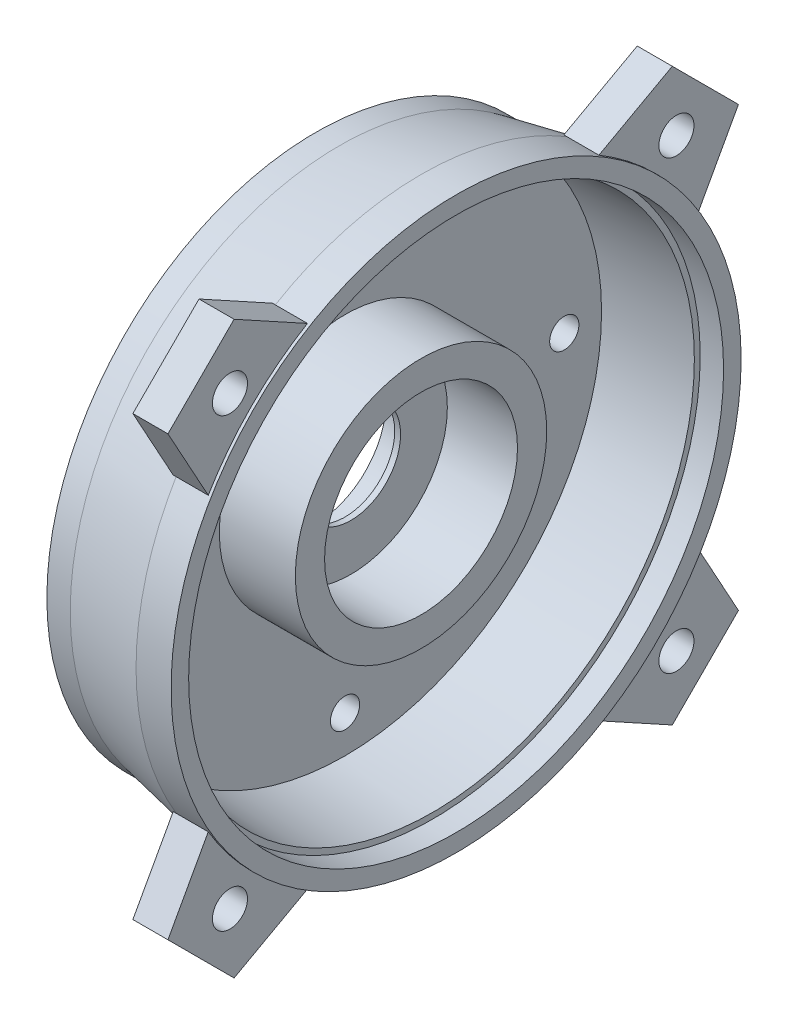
ISO-10303-21;
HEADER;
FILE_DESCRIPTION(('STEP AP214'),'2;1');
FILE_NAME('part.step','',(''),(''),'','','');
FILE_SCHEMA(('AUTOMOTIVE_DESIGN { 1 0 10303 214 1 1 1 1 }'));
ENDSEC;
DATA;
#1=APPLICATION_CONTEXT('core data for automotive mechanical design processes');
#2=APPLICATION_PROTOCOL_DEFINITION('international standard','automotive_design',2000,#1);
#3=PRODUCT_CONTEXT('',#1,'mechanical');
#4=PRODUCT('Part','Part','',(#3));
#5=PRODUCT_RELATED_PRODUCT_CATEGORY('part','',(#4));
#6=PRODUCT_DEFINITION_FORMATION('','',#4);
#7=PRODUCT_DEFINITION_CONTEXT('part definition',#1,'design');
#8=PRODUCT_DEFINITION('design','',#6,#7);
#9=PRODUCT_DEFINITION_SHAPE('','',#8);
#10=(LENGTH_UNIT() NAMED_UNIT(*) SI_UNIT(.MILLI.,.METRE.));
#11=(NAMED_UNIT(*) PLANE_ANGLE_UNIT() SI_UNIT($,.RADIAN.));
#12=(NAMED_UNIT(*) SI_UNIT($,.STERADIAN.) SOLID_ANGLE_UNIT());
#13=UNCERTAINTY_MEASURE_WITH_UNIT(LENGTH_MEASURE(1.E-05),#10,'distance_accuracy_value','');
#14=(GEOMETRIC_REPRESENTATION_CONTEXT(3) GLOBAL_UNCERTAINTY_ASSIGNED_CONTEXT((#13)) GLOBAL_UNIT_ASSIGNED_CONTEXT((#10,
#11,#12)) REPRESENTATION_CONTEXT('',''));
#15=CARTESIAN_POINT('',(0.,0.,0.));
#16=DIRECTION('',(0.,0.,1.));
#17=DIRECTION('',(1.,0.,0.));
#18=AXIS2_PLACEMENT_3D('',#15,#16,#17);
#19=CARTESIAN_POINT('',(110.,0.,0.));
#20=DIRECTION('',(1.,0.,0.));
#21=DIRECTION('',(0.,0.,-1.));
#22=AXIS2_PLACEMENT_3D('',#19,#20,#21);
#23=CYLINDRICAL_SURFACE('',#22,8.5);
#24=CARTESIAN_POINT('',(0.,0.,0.));
#25=DIRECTION('',(1.,0.,0.));
#26=DIRECTION('',(0.,0.,-1.));
#27=AXIS2_PLACEMENT_3D('',#24,#25,#26);
#28=CIRCLE('',#27,8.5);
#29=CARTESIAN_POINT('',(0.,0.,-8.5));
#30=VERTEX_POINT('',#29);
#31=EDGE_CURVE('E501',#30,#30,#28,.T.);
#32=ORIENTED_EDGE('',*,*,#31,.F.);
#33=EDGE_LOOP('',(#32));
#34=FACE_BOUND('',#33,.T.);
#35=CARTESIAN_POINT('',(1.,0.,0.));
#36=DIRECTION('',(1.,0.,0.));
#37=DIRECTION('',(0.,0.,-1.));
#38=AXIS2_PLACEMENT_3D('',#35,#36,#37);
#39=CIRCLE('',#38,8.5);
#40=CARTESIAN_POINT('',(1.,0.,-8.5));
#41=VERTEX_POINT('',#40);
#42=EDGE_CURVE('E410',#41,#41,#39,.T.);
#43=ORIENTED_EDGE('',*,*,#42,.T.);
#44=EDGE_LOOP('',(#43));
#45=FACE_BOUND('',#44,.T.);
#46=ADVANCED_FACE('F16',(#34,#45),#23,.F.);
#47=CARTESIAN_POINT('',(0.,-8.5,0.));
#48=DIRECTION('',(1.,0.,0.));
#49=DIRECTION('',(0.,0.,-1.));
#50=AXIS2_PLACEMENT_3D('',#47,#48,#49);
#51=PLANE('',#50);
#52=CARTESIAN_POINT('',(0.,0.,0.));
#53=DIRECTION('',(1.,0.,0.));
#54=DIRECTION('',(0.,0.,-1.));
#55=AXIS2_PLACEMENT_3D('',#52,#53,#54);
#56=CIRCLE('',#55,12.);
#57=CARTESIAN_POINT('',(0.,0.,-12.));
#58=VERTEX_POINT('',#57);
#59=EDGE_CURVE('E497',#58,#58,#56,.T.);
#60=ORIENTED_EDGE('',*,*,#59,.F.);
#61=EDGE_LOOP('',(#60));
#62=FACE_BOUND('',#61,.T.);
#63=ORIENTED_EDGE('',*,*,#31,.T.);
#64=EDGE_LOOP('',(#63));
#65=FACE_BOUND('',#64,.T.);
#66=ADVANCED_FACE('F573',(#62,#65),#51,.F.);
#67=CARTESIAN_POINT('',(110.,0.,0.));
#68=DIRECTION('',(1.,0.,0.));
#69=DIRECTION('',(0.,0.,-1.));
#70=AXIS2_PLACEMENT_3D('',#67,#68,#69);
#71=CYLINDRICAL_SURFACE('',#70,12.);
#72=CARTESIAN_POINT('',(-5.,0.,0.));
#73=DIRECTION('',(1.,0.,0.));
#74=DIRECTION('',(0.,0.,-1.));
#75=AXIS2_PLACEMENT_3D('',#72,#73,#74);
#76=CIRCLE('',#75,12.);
#77=CARTESIAN_POINT('',(-5.,0.,-12.));
#78=VERTEX_POINT('',#77);
#79=EDGE_CURVE('E493',#78,#78,#76,.T.);
#80=ORIENTED_EDGE('',*,*,#79,.F.);
#81=EDGE_LOOP('',(#80));
#82=FACE_BOUND('',#81,.T.);
#83=ORIENTED_EDGE('',*,*,#59,.T.);
#84=EDGE_LOOP('',(#83));
#85=FACE_BOUND('',#84,.T.);
#86=ADVANCED_FACE('F578',(#82,#85),#71,.F.);
#87=CARTESIAN_POINT('',(-5.,-12.,0.));
#88=DIRECTION('',(1.,0.,0.));
#89=DIRECTION('',(0.,0.,-1.));
#90=AXIS2_PLACEMENT_3D('',#87,#88,#89);
#91=PLANE('',#90);
#92=CARTESIAN_POINT('',(-5.,0.,0.));
#93=DIRECTION('',(1.,0.,0.));
#94=DIRECTION('',(0.,0.,-1.));
#95=AXIS2_PLACEMENT_3D('',#92,#93,#94);
#96=CIRCLE('',#95,16.);
#97=CARTESIAN_POINT('',(-5.,0.,-16.));
#98=VERTEX_POINT('',#97);
#99=EDGE_CURVE('E489',#98,#98,#96,.T.);
#100=ORIENTED_EDGE('',*,*,#99,.F.);
#101=EDGE_LOOP('',(#100));
#102=FACE_BOUND('',#101,.T.);
#103=ORIENTED_EDGE('',*,*,#79,.T.);
#104=EDGE_LOOP('',(#103));
#105=FACE_BOUND('',#104,.T.);
#106=ADVANCED_FACE('F674',(#102,#105),#91,.F.);
#107=CARTESIAN_POINT('',(110.,0.,0.));
#108=DIRECTION('',(1.,0.,0.));
#109=DIRECTION('',(0.,0.,-1.));
#110=AXIS2_PLACEMENT_3D('',#107,#108,#109);
#111=CYLINDRICAL_SURFACE('',#110,16.);
#112=CARTESIAN_POINT('',(-2.5,0.,0.));
#113=DIRECTION('',(1.,0.,0.));
#114=DIRECTION('',(0.,0.,-1.));
#115=AXIS2_PLACEMENT_3D('',#112,#113,#114);
#116=CIRCLE('',#115,16.);
#117=CARTESIAN_POINT('',(-2.5,0.,-16.));
#118=VERTEX_POINT('',#117);
#119=EDGE_CURVE('E485',#118,#118,#116,.T.);
#120=ORIENTED_EDGE('',*,*,#119,.F.);
#121=EDGE_LOOP('',(#120));
#122=FACE_BOUND('',#121,.T.);
#123=ORIENTED_EDGE('',*,*,#99,.T.);
#124=EDGE_LOOP('',(#123));
#125=FACE_BOUND('',#124,.T.);
#126=ADVANCED_FACE('F670',(#122,#125),#111,.T.);
#127=CARTESIAN_POINT('',(-2.5,-16.,0.));
#128=DIRECTION('',(1.,0.,0.));
#129=DIRECTION('',(0.,0.,-1.));
#130=AXIS2_PLACEMENT_3D('',#127,#128,#129);
#131=PLANE('',#130);
#132=CARTESIAN_POINT('',(-2.5,0.,0.));
#133=DIRECTION('',(1.,0.,0.));
#134=DIRECTION('',(0.,0.,-1.));
#135=AXIS2_PLACEMENT_3D('',#132,#133,#134);
#136=CIRCLE('',#135,22.75);
#137=CARTESIAN_POINT('',(-2.5,0.,-22.75));
#138=VERTEX_POINT('',#137);
#139=EDGE_CURVE('E481',#138,#138,#136,.T.);
#140=ORIENTED_EDGE('',*,*,#139,.F.);
#141=EDGE_LOOP('',(#140));
#142=FACE_BOUND('',#141,.T.);
#143=ORIENTED_EDGE('',*,*,#119,.T.);
#144=EDGE_LOOP('',(#143));
#145=FACE_BOUND('',#144,.T.);
#146=ADVANCED_FACE('F666',(#142,#145),#131,.F.);
#147=CARTESIAN_POINT('',(110.,0.,0.));
#148=DIRECTION('',(1.,0.,0.));
#149=DIRECTION('',(0.,0.,-1.));
#150=AXIS2_PLACEMENT_3D('',#147,#148,#149);
#151=CYLINDRICAL_SURFACE('',#150,22.75);
#152=CARTESIAN_POINT('',(-7.5,0.,0.));
#153=DIRECTION('',(1.,0.,0.));
#154=DIRECTION('',(0.,0.,-1.));
#155=AXIS2_PLACEMENT_3D('',#152,#153,#154);
#156=CIRCLE('',#155,22.75);
#157=CARTESIAN_POINT('',(-7.5,0.,-22.75));
#158=VERTEX_POINT('',#157);
#159=EDGE_CURVE('E477',#158,#158,#156,.T.);
#160=ORIENTED_EDGE('',*,*,#159,.F.);
#161=EDGE_LOOP('',(#160));
#162=FACE_BOUND('',#161,.T.);
#163=ORIENTED_EDGE('',*,*,#139,.T.);
#164=EDGE_LOOP('',(#163));
#165=FACE_BOUND('',#164,.T.);
#166=ADVANCED_FACE('F662',(#162,#165),#151,.F.);
#167=CARTESIAN_POINT('',(-7.5,-22.75,0.));
#168=DIRECTION('',(1.,0.,0.));
#169=DIRECTION('',(0.,0.,-1.));
#170=AXIS2_PLACEMENT_3D('',#167,#168,#169);
#171=PLANE('',#170);
#172=CARTESIAN_POINT('',(-7.5,0.,0.));
#173=DIRECTION('',(1.,0.,0.));
#174=DIRECTION('',(0.,0.,-1.));
#175=AXIS2_PLACEMENT_3D('',#172,#173,#174);
#176=CIRCLE('',#175,30.);
#177=CARTESIAN_POINT('',(-7.5,0.,-30.));
#178=VERTEX_POINT('',#177);
#179=EDGE_CURVE('E473',#178,#178,#176,.T.);
#180=ORIENTED_EDGE('',*,*,#179,.F.);
#181=EDGE_LOOP('',(#180));
#182=FACE_BOUND('',#181,.T.);
#183=ORIENTED_EDGE('',*,*,#159,.T.);
#184=EDGE_LOOP('',(#183));
#185=FACE_BOUND('',#184,.T.);
#186=ADVANCED_FACE('F658',(#182,#185),#171,.F.);
#187=CARTESIAN_POINT('',(110.,0.,0.));
#188=DIRECTION('',(1.,0.,0.));
#189=DIRECTION('',(0.,0.,-1.));
#190=AXIS2_PLACEMENT_3D('',#187,#188,#189);
#191=CYLINDRICAL_SURFACE('',#190,30.);
#192=CARTESIAN_POINT('',(-5.,0.,0.));
#193=DIRECTION('',(1.,0.,0.));
#194=DIRECTION('',(0.,0.,-1.));
#195=AXIS2_PLACEMENT_3D('',#192,#193,#194);
#196=CIRCLE('',#195,30.);
#197=CARTESIAN_POINT('',(-5.,0.,-30.));
#198=VERTEX_POINT('',#197);
#199=EDGE_CURVE('E469',#198,#198,#196,.T.);
#200=ORIENTED_EDGE('',*,*,#199,.F.);
#201=EDGE_LOOP('',(#200));
#202=FACE_BOUND('',#201,.T.);
#203=ORIENTED_EDGE('',*,*,#179,.T.);
#204=EDGE_LOOP('',(#203));
#205=FACE_BOUND('',#204,.T.);
#206=ADVANCED_FACE('F654',(#202,#205),#191,.T.);
#207=CARTESIAN_POINT('',(-5.,-30.,0.));
#208=DIRECTION('',(1.,0.,0.));
#209=DIRECTION('',(0.,0.,-1.));
#210=AXIS2_PLACEMENT_3D('',#207,#208,#209);
#211=PLANE('',#210);
#212=CARTESIAN_POINT('',(-4.99999999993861,-1.45716771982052E-13,-37.5));
#213=DIRECTION('',(-1.,0.,0.));
#214=DIRECTION('',(0.,0.,-1.));
#215=AXIS2_PLACEMENT_3D('',#212,#213,#214);
#216=CIRCLE('',#215,2.5);
#217=CARTESIAN_POINT('',(-4.99999999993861,-1.45716771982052E-13,-40.));
#218=VERTEX_POINT('',#217);
#219=EDGE_CURVE('E222',#218,#218,#216,.T.);
#220=ORIENTED_EDGE('',*,*,#219,.F.);
#221=EDGE_LOOP('',(#220));
#222=FACE_BOUND('',#221,.T.);
#223=CARTESIAN_POINT('',(-4.99999999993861,-37.5,2.81025203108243E-13));
#224=DIRECTION('',(-1.,0.,0.));
#225=DIRECTION('',(0.,0.,1.));
#226=AXIS2_PLACEMENT_3D('',#223,#224,#225);
#227=CIRCLE('',#226,2.5);
#228=CARTESIAN_POINT('',(-4.99999999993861,-37.5,2.50000000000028));
#229=VERTEX_POINT('',#228);
#230=EDGE_CURVE('E205',#229,#229,#227,.T.);
#231=ORIENTED_EDGE('',*,*,#230,.F.);
#232=EDGE_LOOP('',(#231));
#233=FACE_BOUND('',#232,.T.);
#234=CARTESIAN_POINT('',(-4.99999999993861,-1.31838984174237E-13,37.5));
#235=DIRECTION('',(-1.,0.,0.));
#236=DIRECTION('',(0.,0.,-1.));
#237=AXIS2_PLACEMENT_3D('',#234,#235,#236);
#238=CIRCLE('',#237,2.5);
#239=CARTESIAN_POINT('',(-4.99999999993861,-1.31838984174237E-13,35.));
#240=VERTEX_POINT('',#239);
#241=EDGE_CURVE('E201',#240,#240,#238,.T.);
#242=ORIENTED_EDGE('',*,*,#241,.F.);
#243=EDGE_LOOP('',(#242));
#244=FACE_BOUND('',#243,.T.);
#245=CARTESIAN_POINT('',(-4.99999999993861,37.5,0.));
#246=DIRECTION('',(-1.,0.,0.));
#247=DIRECTION('',(0.,0.,1.));
#248=AXIS2_PLACEMENT_3D('',#245,#246,#247);
#249=CIRCLE('',#248,2.5);
#250=CARTESIAN_POINT('',(-4.99999999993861,37.5,2.5));
#251=VERTEX_POINT('',#250);
#252=EDGE_CURVE('E197',#251,#251,#249,.T.);
#253=ORIENTED_EDGE('',*,*,#252,.F.);
#254=EDGE_LOOP('',(#253));
#255=FACE_BOUND('',#254,.T.);
#256=CARTESIAN_POINT('',(-5.,0.,0.));
#257=DIRECTION('',(1.,0.,0.));
#258=DIRECTION('',(0.,0.,-1.));
#259=AXIS2_PLACEMENT_3D('',#256,#257,#258);
#260=CIRCLE('',#259,46.);
#261=CARTESIAN_POINT('',(-5.,0.,-46.));
#262=VERTEX_POINT('',#261);
#263=EDGE_CURVE('E466',#262,#262,#260,.T.);
#264=ORIENTED_EDGE('',*,*,#263,.F.);
#265=EDGE_LOOP('',(#264));
#266=FACE_BOUND('',#265,.T.);
#267=ORIENTED_EDGE('',*,*,#199,.T.);
#268=EDGE_LOOP('',(#267));
#269=FACE_BOUND('',#268,.T.);
#270=ADVANCED_FACE('F650',(#222,#233,#244,#255,#266,#269),#211,.F.);
#271=CARTESIAN_POINT('',(110.,0.,0.));
#272=DIRECTION('',(1.,0.,0.));
#273=DIRECTION('',(0.,0.,-1.));
#274=AXIS2_PLACEMENT_3D('',#271,#272,#273);
#275=CYLINDRICAL_SURFACE('',#274,46.);
#276=CARTESIAN_POINT('',(-1.00000000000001,0.,0.));
#277=DIRECTION('',(1.,0.,0.));
#278=DIRECTION('',(0.,0.,-1.));
#279=AXIS2_PLACEMENT_3D('',#276,#277,#278);
#280=CIRCLE('',#279,46.);
#281=CARTESIAN_POINT('',(-1.00000000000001,0.,-46.));
#282=VERTEX_POINT('',#281);
#283=EDGE_CURVE('E461',#282,#282,#280,.T.);
#284=ORIENTED_EDGE('',*,*,#283,.F.);
#285=EDGE_LOOP('',(#284));
#286=FACE_BOUND('',#285,.T.);
#287=ORIENTED_EDGE('',*,*,#263,.T.);
#288=EDGE_LOOP('',(#287));
#289=FACE_BOUND('',#288,.T.);
#290=ADVANCED_FACE('F645',(#286,#289),#275,.T.);
#291=CARTESIAN_POINT('',(-1.00000000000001,0.,0.));
#292=DIRECTION('',(1.,0.,0.));
#293=DIRECTION('',(0.,0.,-1.));
#294=AXIS2_PLACEMENT_3D('',#291,#292,#293);
#295=CONICAL_SURFACE('',#294,46.,0.193959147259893);
#296=CARTESIAN_POINT('',(13.,0.,0.));
#297=DIRECTION('',(1.,0.,0.));
#298=DIRECTION('',(0.,0.,-1.));
#299=AXIS2_PLACEMENT_3D('',#296,#297,#298);
#300=CIRCLE('',#299,48.75);
#301=CARTESIAN_POINT('',(13.,41.896076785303,24.9255140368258));
#302=VERTEX_POINT('',#301);
#303=CARTESIAN_POINT('',(13.,24.9255140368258,41.896076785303));
#304=VERTEX_POINT('',#303);
#305=EDGE_CURVE('E459',#302,#304,#300,.T.);
#306=ORIENTED_EDGE('',*,*,#305,.F.);
#307=CARTESIAN_POINT('',(13.,41.8960767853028,-24.9255140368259));
#308=VERTEX_POINT('',#307);
#309=EDGE_CURVE('E458',#308,#302,#300,.T.);
#310=ORIENTED_EDGE('',*,*,#309,.F.);
#311=CARTESIAN_POINT('',(13.,24.9255140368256,-41.8960767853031));
#312=VERTEX_POINT('',#311);
#313=EDGE_CURVE('E544',#312,#308,#300,.T.);
#314=ORIENTED_EDGE('',*,*,#313,.F.);
#315=CARTESIAN_POINT('',(13.,-24.9255140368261,-41.8960767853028));
#316=VERTEX_POINT('',#315);
#317=EDGE_CURVE('E538',#316,#312,#300,.T.);
#318=ORIENTED_EDGE('',*,*,#317,.F.);
#319=CARTESIAN_POINT('',(13.,-41.8960767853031,-24.9255140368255));
#320=VERTEX_POINT('',#319);
#321=EDGE_CURVE('E529',#320,#316,#300,.T.);
#322=ORIENTED_EDGE('',*,*,#321,.F.);
#323=CARTESIAN_POINT('',(13.,-41.8960767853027,24.9255140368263));
#324=VERTEX_POINT('',#323);
#325=EDGE_CURVE('E462',#324,#320,#300,.T.);
#326=ORIENTED_EDGE('',*,*,#325,.F.);
#327=CARTESIAN_POINT('',(13.,-24.9255140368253,41.8960767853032));
#328=VERTEX_POINT('',#327);
#329=EDGE_CURVE('E542',#328,#324,#300,.T.);
#330=ORIENTED_EDGE('',*,*,#329,.F.);
#331=EDGE_CURVE('E179',#304,#328,#300,.T.);
#332=ORIENTED_EDGE('',*,*,#331,.F.);
#333=EDGE_LOOP('',(#306,#310,#314,#318,#322,#326,#330,#332));
#334=FACE_BOUND('',#333,.T.);
#335=ORIENTED_EDGE('',*,*,#283,.T.);
#336=EDGE_LOOP('',(#335));
#337=FACE_BOUND('',#336,.T.);
#338=ADVANCED_FACE('F534',(#334,#337),#295,.T.);
#339=CARTESIAN_POINT('',(110.,0.,0.));
#340=DIRECTION('',(1.,0.,0.));
#341=DIRECTION('',(0.,0.,-1.));
#342=AXIS2_PLACEMENT_3D('',#339,#340,#341);
#343=CYLINDRICAL_SURFACE('',#342,48.75);
#344=CARTESIAN_POINT('',(19.,0.,0.));
#345=DIRECTION('',(1.,0.,0.));
#346=DIRECTION('',(0.,0.,-1.));
#347=AXIS2_PLACEMENT_3D('',#344,#345,#346);
#348=CIRCLE('',#347,48.75);
#349=CARTESIAN_POINT('',(19.,0.,-48.75));
#350=VERTEX_POINT('',#349);
#351=EDGE_CURVE('E454',#350,#350,#348,.T.);
#352=ORIENTED_EDGE('',*,*,#351,.F.);
#353=EDGE_LOOP('',(#352));
#354=FACE_BOUND('',#353,.T.);
#355=CARTESIAN_POINT('',(18.5,0.,0.));
#356=DIRECTION('',(-1.,0.,0.));
#357=DIRECTION('',(0.,1.,0.));
#358=AXIS2_PLACEMENT_3D('',#355,#356,#357);
#359=CIRCLE('',#358,48.75);
#360=CARTESIAN_POINT('',(18.5,-41.8960767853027,24.9255140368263));
#361=VERTEX_POINT('',#360);
#362=CARTESIAN_POINT('',(18.5,-24.9255140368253,41.8960767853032));
#363=VERTEX_POINT('',#362);
#364=EDGE_CURVE('E167',#361,#363,#359,.T.);
#365=ORIENTED_EDGE('',*,*,#364,.F.);
#366=DIRECTION('',(1.,0.,0.));
#367=VECTOR('',#366,1.);
#368=CARTESIAN_POINT('',(110.,-41.8960767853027,24.9255140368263));
#369=LINE('',#368,#367);
#370=EDGE_CURVE('E11',#361,#324,#369,.F.);
#371=ORIENTED_EDGE('',*,*,#370,.T.);
#372=ORIENTED_EDGE('',*,*,#325,.T.);
#373=DIRECTION('',(1.,0.,0.));
#374=VECTOR('',#373,1.);
#375=CARTESIAN_POINT('',(110.,-41.8960767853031,-24.9255140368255));
#376=LINE('',#375,#374);
#377=CARTESIAN_POINT('',(18.5,-41.8960767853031,-24.9255140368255));
#378=VERTEX_POINT('',#377);
#379=EDGE_CURVE('E188',#320,#378,#376,.T.);
#380=ORIENTED_EDGE('',*,*,#379,.T.);
#381=CARTESIAN_POINT('',(18.5,0.,0.));
#382=DIRECTION('',(-1.,0.,0.));
#383=DIRECTION('',(0.,0.,1.));
#384=AXIS2_PLACEMENT_3D('',#381,#382,#383);
#385=CIRCLE('',#384,48.75);
#386=CARTESIAN_POINT('',(18.5,-24.9255140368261,-41.8960767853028));
#387=VERTEX_POINT('',#386);
#388=EDGE_CURVE('E281',#387,#378,#385,.T.);
#389=ORIENTED_EDGE('',*,*,#388,.F.);
#390=DIRECTION('',(1.,0.,0.));
#391=VECTOR('',#390,1.);
#392=CARTESIAN_POINT('',(110.,-24.9255140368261,-41.8960767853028));
#393=LINE('',#392,#391);
#394=EDGE_CURVE('E181',#387,#316,#393,.F.);
#395=ORIENTED_EDGE('',*,*,#394,.T.);
#396=ORIENTED_EDGE('',*,*,#317,.T.);
#397=DIRECTION('',(1.,0.,0.));
#398=VECTOR('',#397,1.);
#399=CARTESIAN_POINT('',(110.,24.9255140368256,-41.8960767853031));
#400=LINE('',#399,#398);
#401=CARTESIAN_POINT('',(18.5,24.9255140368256,-41.8960767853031));
#402=VERTEX_POINT('',#401);
#403=EDGE_CURVE('E511',#312,#402,#400,.T.);
#404=ORIENTED_EDGE('',*,*,#403,.T.);
#405=CARTESIAN_POINT('',(18.5,0.,0.));
#406=DIRECTION('',(-1.,0.,0.));
#407=DIRECTION('',(0.,-1.,0.));
#408=AXIS2_PLACEMENT_3D('',#405,#406,#407);
#409=CIRCLE('',#408,48.75);
#410=CARTESIAN_POINT('',(18.5,41.8960767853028,-24.9255140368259));
#411=VERTEX_POINT('',#410);
#412=EDGE_CURVE('E321',#411,#402,#409,.T.);
#413=ORIENTED_EDGE('',*,*,#412,.F.);
#414=DIRECTION('',(1.,0.,0.));
#415=VECTOR('',#414,1.);
#416=CARTESIAN_POINT('',(110.,41.8960767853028,-24.9255140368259));
#417=LINE('',#416,#415);
#418=EDGE_CURVE('E515',#411,#308,#417,.F.);
#419=ORIENTED_EDGE('',*,*,#418,.T.);
#420=ORIENTED_EDGE('',*,*,#309,.T.);
#421=DIRECTION('',(1.,0.,0.));
#422=VECTOR('',#421,1.);
#423=CARTESIAN_POINT('',(110.,41.896076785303,24.9255140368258));
#424=LINE('',#423,#422);
#425=CARTESIAN_POINT('',(18.5,41.896076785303,24.9255140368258));
#426=VERTEX_POINT('',#425);
#427=EDGE_CURVE('E505',#302,#426,#424,.T.);
#428=ORIENTED_EDGE('',*,*,#427,.T.);
#429=CARTESIAN_POINT('',(18.5,0.,0.));
#430=DIRECTION('',(-1.,0.,0.));
#431=DIRECTION('',(0.,0.,-1.));
#432=AXIS2_PLACEMENT_3D('',#429,#430,#431);
#433=CIRCLE('',#432,48.75);
#434=CARTESIAN_POINT('',(18.5,24.9255140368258,41.896076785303));
#435=VERTEX_POINT('',#434);
#436=EDGE_CURVE('E366',#435,#426,#433,.T.);
#437=ORIENTED_EDGE('',*,*,#436,.F.);
#438=DIRECTION('',(1.,0.,0.));
#439=VECTOR('',#438,1.);
#440=CARTESIAN_POINT('',(110.,24.9255140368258,41.896076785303));
#441=LINE('',#440,#439);
#442=EDGE_CURVE('E509',#435,#304,#441,.F.);
#443=ORIENTED_EDGE('',*,*,#442,.T.);
#444=ORIENTED_EDGE('',*,*,#331,.T.);
#445=DIRECTION('',(1.,0.,0.));
#446=VECTOR('',#445,1.);
#447=CARTESIAN_POINT('',(110.,-24.9255140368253,41.8960767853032));
#448=LINE('',#447,#446);
#449=EDGE_CURVE('E25',#328,#363,#448,.T.);
#450=ORIENTED_EDGE('',*,*,#449,.T.);
#451=EDGE_LOOP('',(#365,#371,#372,#380,#389,#395,#396,#404,#413,#419,#420,#428,#437,#443,#444,#450));
#452=FACE_BOUND('',#451,.T.);
#453=ADVANCED_FACE('F176',(#354,#452),#343,.T.);
#454=CARTESIAN_POINT('',(19.,-48.75,0.));
#455=DIRECTION('',(-1.,0.,0.));
#456=DIRECTION('',(0.,0.,1.));
#457=AXIS2_PLACEMENT_3D('',#454,#455,#456);
#458=PLANE('',#457);
#459=CARTESIAN_POINT('',(19.,0.,0.));
#460=DIRECTION('',(1.,0.,0.));
#461=DIRECTION('',(0.,0.,-1.));
#462=AXIS2_PLACEMENT_3D('',#459,#460,#461);
#463=CIRCLE('',#462,45.75);
#464=CARTESIAN_POINT('',(19.,0.,-45.75));
#465=VERTEX_POINT('',#464);
#466=EDGE_CURVE('E450',#465,#465,#463,.T.);
#467=ORIENTED_EDGE('',*,*,#466,.F.);
#468=EDGE_LOOP('',(#467));
#469=FACE_BOUND('',#468,.T.);
#470=ORIENTED_EDGE('',*,*,#351,.T.);
#471=EDGE_LOOP('',(#470));
#472=FACE_BOUND('',#471,.T.);
#473=ADVANCED_FACE('F631',(#469,#472),#458,.F.);
#474=CARTESIAN_POINT('',(110.,0.,0.));
#475=DIRECTION('',(1.,0.,0.));
#476=DIRECTION('',(0.,0.,-1.));
#477=AXIS2_PLACEMENT_3D('',#474,#475,#476);
#478=CYLINDRICAL_SURFACE('',#477,45.75);
#479=CARTESIAN_POINT('',(15.,0.,0.));
#480=DIRECTION('',(1.,0.,0.));
#481=DIRECTION('',(0.,0.,-1.));
#482=AXIS2_PLACEMENT_3D('',#479,#480,#481);
#483=CIRCLE('',#482,45.75);
#484=CARTESIAN_POINT('',(15.,0.,-45.75));
#485=VERTEX_POINT('',#484);
#486=EDGE_CURVE('E446',#485,#485,#483,.T.);
#487=ORIENTED_EDGE('',*,*,#486,.F.);
#488=EDGE_LOOP('',(#487));
#489=FACE_BOUND('',#488,.T.);
#490=ORIENTED_EDGE('',*,*,#466,.T.);
#491=EDGE_LOOP('',(#490));
#492=FACE_BOUND('',#491,.T.);
#493=ADVANCED_FACE('F625',(#489,#492),#478,.F.);
#494=CARTESIAN_POINT('',(15.,-45.75,0.));
#495=DIRECTION('',(-1.,0.,0.));
#496=DIRECTION('',(0.,0.,1.));
#497=AXIS2_PLACEMENT_3D('',#494,#495,#496);
#498=PLANE('',#497);
#499=CARTESIAN_POINT('',(15.,0.,0.));
#500=DIRECTION('',(1.,0.,0.));
#501=DIRECTION('',(0.,0.,-1.));
#502=AXIS2_PLACEMENT_3D('',#499,#500,#501);
#503=CIRCLE('',#502,44.75);
#504=CARTESIAN_POINT('',(15.,0.,-44.75));
#505=VERTEX_POINT('',#504);
#506=EDGE_CURVE('E442',#505,#505,#503,.T.);
#507=ORIENTED_EDGE('',*,*,#506,.F.);
#508=EDGE_LOOP('',(#507));
#509=FACE_BOUND('',#508,.T.);
#510=ORIENTED_EDGE('',*,*,#486,.T.);
#511=EDGE_LOOP('',(#510));
#512=FACE_BOUND('',#511,.T.);
#513=ADVANCED_FACE('F619',(#509,#512),#498,.F.);
#514=CARTESIAN_POINT('',(15.,0.,0.));
#515=DIRECTION('',(1.,0.,0.));
#516=DIRECTION('',(0.,0.,-1.));
#517=AXIS2_PLACEMENT_3D('',#514,#515,#516);
#518=CONICAL_SURFACE('',#517,44.75,0.0581238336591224);
#519=CARTESIAN_POINT('',(0.,0.,0.));
#520=DIRECTION('',(1.,0.,0.));
#521=DIRECTION('',(0.,0.,-1.));
#522=AXIS2_PLACEMENT_3D('',#519,#520,#521);
#523=CIRCLE('',#522,43.8771593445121);
#524=CARTESIAN_POINT('',(0.,0.,-43.8771593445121));
#525=VERTEX_POINT('',#524);
#526=EDGE_CURVE('E438',#525,#525,#523,.T.);
#527=ORIENTED_EDGE('',*,*,#526,.F.);
#528=EDGE_LOOP('',(#527));
#529=FACE_BOUND('',#528,.T.);
#530=ORIENTED_EDGE('',*,*,#506,.T.);
#531=EDGE_LOOP('',(#530));
#532=FACE_BOUND('',#531,.T.);
#533=ADVANCED_FACE('F612',(#529,#532),#518,.F.);
#534=CARTESIAN_POINT('',(0.,-43.8771593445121,0.));
#535=DIRECTION('',(-1.,0.,0.));
#536=DIRECTION('',(0.,0.,1.));
#537=AXIS2_PLACEMENT_3D('',#534,#535,#536);
#538=PLANE('',#537);
#539=CARTESIAN_POINT('',(0.,-1.45716771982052E-13,-37.5));
#540=DIRECTION('',(-1.,0.,0.));
#541=DIRECTION('',(0.,0.,1.));
#542=AXIS2_PLACEMENT_3D('',#539,#540,#541);
#543=CIRCLE('',#542,2.5);
#544=CARTESIAN_POINT('',(0.,-1.45716771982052E-13,-35.));
#545=VERTEX_POINT('',#544);
#546=EDGE_CURVE('E19',#545,#545,#543,.T.);
#547=ORIENTED_EDGE('',*,*,#546,.T.);
#548=EDGE_LOOP('',(#547));
#549=FACE_BOUND('',#548,.T.);
#550=CARTESIAN_POINT('',(0.,-37.5,2.81025203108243E-13));
#551=DIRECTION('',(-1.,0.,0.));
#552=DIRECTION('',(0.,0.,1.));
#553=AXIS2_PLACEMENT_3D('',#550,#551,#552);
#554=CIRCLE('',#553,2.5);
#555=CARTESIAN_POINT('',(0.,-37.5,2.50000000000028));
#556=VERTEX_POINT('',#555);
#557=EDGE_CURVE('E202',#556,#556,#554,.T.);
#558=ORIENTED_EDGE('',*,*,#557,.T.);
#559=EDGE_LOOP('',(#558));
#560=FACE_BOUND('',#559,.T.);
#561=CARTESIAN_POINT('',(0.,-1.31838984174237E-13,37.5));
#562=DIRECTION('',(-1.,0.,0.));
#563=DIRECTION('',(0.,0.,1.));
#564=AXIS2_PLACEMENT_3D('',#561,#562,#563);
#565=CIRCLE('',#564,2.5);
#566=CARTESIAN_POINT('',(0.,-1.31838984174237E-13,40.));
#567=VERTEX_POINT('',#566);
#568=EDGE_CURVE('E198',#567,#567,#565,.T.);
#569=ORIENTED_EDGE('',*,*,#568,.T.);
#570=EDGE_LOOP('',(#569));
#571=FACE_BOUND('',#570,.T.);
#572=CARTESIAN_POINT('',(0.,37.5,0.));
#573=DIRECTION('',(-1.,0.,0.));
#574=DIRECTION('',(0.,0.,1.));
#575=AXIS2_PLACEMENT_3D('',#572,#573,#574);
#576=CIRCLE('',#575,2.5);
#577=CARTESIAN_POINT('',(0.,37.5,2.5));
#578=VERTEX_POINT('',#577);
#579=EDGE_CURVE('E192',#578,#578,#576,.T.);
#580=ORIENTED_EDGE('',*,*,#579,.T.);
#581=EDGE_LOOP('',(#580));
#582=FACE_BOUND('',#581,.T.);
#583=CARTESIAN_POINT('',(0.,0.,0.));
#584=DIRECTION('',(1.,0.,0.));
#585=DIRECTION('',(0.,0.,-1.));
#586=AXIS2_PLACEMENT_3D('',#583,#584,#585);
#587=CIRCLE('',#586,21.5);
#588=CARTESIAN_POINT('',(0.,0.,-21.5));
#589=VERTEX_POINT('',#588);
#590=EDGE_CURVE('E434',#589,#589,#587,.T.);
#591=ORIENTED_EDGE('',*,*,#590,.F.);
#592=EDGE_LOOP('',(#591));
#593=FACE_BOUND('',#592,.T.);
#594=ORIENTED_EDGE('',*,*,#526,.T.);
#595=EDGE_LOOP('',(#594));
#596=FACE_BOUND('',#595,.T.);
#597=ADVANCED_FACE('F606',(#549,#560,#571,#582,#593,#596),#538,.F.);
#598=CARTESIAN_POINT('',(110.,0.,0.));
#599=DIRECTION('',(1.,0.,0.));
#600=DIRECTION('',(0.,0.,-1.));
#601=AXIS2_PLACEMENT_3D('',#598,#599,#600);
#602=CYLINDRICAL_SURFACE('',#601,21.5);
#603=CARTESIAN_POINT('',(13.,0.,0.));
#604=DIRECTION('',(1.,0.,0.));
#605=DIRECTION('',(0.,0.,-1.));
#606=AXIS2_PLACEMENT_3D('',#603,#604,#605);
#607=CIRCLE('',#606,21.5);
#608=CARTESIAN_POINT('',(13.,0.,-21.5));
#609=VERTEX_POINT('',#608);
#610=EDGE_CURVE('E431',#609,#609,#607,.T.);
#611=ORIENTED_EDGE('',*,*,#610,.F.);
#612=EDGE_LOOP('',(#611));
#613=FACE_BOUND('',#612,.T.);
#614=ORIENTED_EDGE('',*,*,#590,.T.);
#615=EDGE_LOOP('',(#614));
#616=FACE_BOUND('',#615,.T.);
#617=ADVANCED_FACE('F600',(#613,#616),#602,.T.);
#618=CARTESIAN_POINT('',(13.,-16.5,0.));
#619=DIRECTION('',(-1.,0.,0.));
#620=DIRECTION('',(0.,0.,1.));
#621=AXIS2_PLACEMENT_3D('',#618,#619,#620);
#622=PLANE('',#621);
#623=CARTESIAN_POINT('',(13.,0.,0.));
#624=DIRECTION('',(1.,0.,0.));
#625=DIRECTION('',(0.,0.,-1.));
#626=AXIS2_PLACEMENT_3D('',#623,#624,#625);
#627=CIRCLE('',#626,16.5);
#628=CARTESIAN_POINT('',(13.,0.,-16.5));
#629=VERTEX_POINT('',#628);
#630=EDGE_CURVE('E427',#629,#629,#627,.T.);
#631=ORIENTED_EDGE('',*,*,#630,.F.);
#632=EDGE_LOOP('',(#631));
#633=FACE_BOUND('',#632,.T.);
#634=ORIENTED_EDGE('',*,*,#610,.T.);
#635=EDGE_LOOP('',(#634));
#636=FACE_BOUND('',#635,.T.);
#637=ADVANCED_FACE('F594',(#633,#636),#622,.F.);
#638=CARTESIAN_POINT('',(110.,0.,0.));
#639=DIRECTION('',(1.,0.,0.));
#640=DIRECTION('',(0.,0.,-1.));
#641=AXIS2_PLACEMENT_3D('',#638,#639,#640);
#642=CYLINDRICAL_SURFACE('',#641,16.5);
#643=CARTESIAN_POINT('',(1.,0.,0.));
#644=DIRECTION('',(1.,0.,0.));
#645=DIRECTION('',(0.,0.,-1.));
#646=AXIS2_PLACEMENT_3D('',#643,#644,#645);
#647=CIRCLE('',#646,16.5);
#648=CARTESIAN_POINT('',(1.,0.,-16.5));
#649=VERTEX_POINT('',#648);
#650=EDGE_CURVE('E423',#649,#649,#647,.T.);
#651=ORIENTED_EDGE('',*,*,#650,.F.);
#652=EDGE_LOOP('',(#651));
#653=FACE_BOUND('',#652,.T.);
#654=ORIENTED_EDGE('',*,*,#630,.T.);
#655=EDGE_LOOP('',(#654));
#656=FACE_BOUND('',#655,.T.);
#657=ADVANCED_FACE('F588',(#653,#656),#642,.F.);
#658=CARTESIAN_POINT('',(1.,-8.5,0.));
#659=DIRECTION('',(-1.,0.,0.));
#660=DIRECTION('',(0.,0.,1.));
#661=AXIS2_PLACEMENT_3D('',#658,#659,#660);
#662=PLANE('',#661);
#663=ORIENTED_EDGE('',*,*,#42,.F.);
#664=EDGE_LOOP('',(#663));
#665=FACE_BOUND('',#664,.T.);
#666=ORIENTED_EDGE('',*,*,#650,.T.);
#667=EDGE_LOOP('',(#666));
#668=FACE_BOUND('',#667,.T.);
#669=ADVANCED_FACE('F584',(#665,#668),#662,.F.);
#670=CARTESIAN_POINT('',(12.5,0.,0.));
#671=DIRECTION('',(1.,0.,0.));
#672=DIRECTION('',(0.,0.,-1.));
#673=AXIS2_PLACEMENT_3D('',#670,#671,#672);
#674=CYLINDRICAL_SURFACE('',#673,48.75);
#675=ORIENTED_EDGE('',*,*,#305,.T.);
#676=DIRECTION('',(1.,0.,0.));
#677=VECTOR('',#676,1.);
#678=CARTESIAN_POINT('',(12.5,24.9255140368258,41.896076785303));
#679=LINE('',#678,#677);
#680=CARTESIAN_POINT('',(12.5,24.9255140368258,41.896076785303));
#681=VERTEX_POINT('',#680);
#682=EDGE_CURVE('E406',#681,#304,#679,.T.);
#683=ORIENTED_EDGE('',*,*,#682,.F.);
#684=CARTESIAN_POINT('',(12.5,0.,0.));
#685=DIRECTION('',(-1.,0.,0.));
#686=DIRECTION('',(0.,0.,-1.));
#687=AXIS2_PLACEMENT_3D('',#684,#685,#686);
#688=CIRCLE('',#687,48.75);
#689=CARTESIAN_POINT('',(12.5,41.896076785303,24.9255140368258));
#690=VERTEX_POINT('',#689);
#691=EDGE_CURVE('E389',#681,#690,#688,.T.);
#692=ORIENTED_EDGE('',*,*,#691,.T.);
#693=DIRECTION('',(1.,0.,0.));
#694=VECTOR('',#693,1.);
#695=CARTESIAN_POINT('',(12.5,41.896076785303,24.9255140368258));
#696=LINE('',#695,#694);
#697=EDGE_CURVE('E405',#690,#302,#696,.T.);
#698=ORIENTED_EDGE('',*,*,#697,.T.);
#699=EDGE_LOOP('',(#675,#683,#692,#698));
#700=FACE_BOUND('',#699,.T.);
#701=ADVANCED_FACE('F587',(#700),#674,.F.);
#702=CARTESIAN_POINT('',(12.5,24.9255140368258,41.896076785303));
#703=DIRECTION('',(0.,-0.481444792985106,0.876476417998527));
#704=DIRECTION('',(0.,-0.876476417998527,-0.481444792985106));
#705=AXIS2_PLACEMENT_3D('',#702,#703,#704);
#706=PLANE('',#705);
#707=DIRECTION('',(0.,-0.876476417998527,-0.481444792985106));
#708=VECTOR('',#707,1.);
#709=CARTESIAN_POINT('',(18.5,24.9255140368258,41.896076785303));
#710=LINE('',#709,#708);
#711=CARTESIAN_POINT('',(18.5,37.476659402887,48.7903679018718));
#712=VERTEX_POINT('',#711);
#713=EDGE_CURVE('E386',#712,#435,#710,.T.);
#714=ORIENTED_EDGE('',*,*,#713,.F.);
#715=DIRECTION('',(1.,0.,0.));
#716=VECTOR('',#715,1.);
#717=CARTESIAN_POINT('',(12.5,37.476659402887,48.7903679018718));
#718=LINE('',#717,#716);
#719=CARTESIAN_POINT('',(12.5,37.476659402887,48.7903679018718));
#720=VERTEX_POINT('',#719);
#721=EDGE_CURVE('E411',#720,#712,#718,.T.);
#722=ORIENTED_EDGE('',*,*,#721,.F.);
#723=DIRECTION('',(0.,-0.876476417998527,-0.481444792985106));
#724=VECTOR('',#723,1.);
#725=CARTESIAN_POINT('',(12.5,24.9255140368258,41.896076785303));
#726=LINE('',#725,#724);
#727=EDGE_CURVE('E401',#720,#681,#726,.T.);
#728=ORIENTED_EDGE('',*,*,#727,.T.);
#729=ORIENTED_EDGE('',*,*,#682,.T.);
#730=ORIENTED_EDGE('',*,*,#442,.F.);
#731=EDGE_LOOP('',(#714,#722,#728,#729,#730));
#732=FACE_BOUND('',#731,.T.);
#733=ADVANCED_FACE('F788',(#732),#706,.T.);
#734=CARTESIAN_POINT('',(12.5,37.476659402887,48.7903679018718));
#735=DIRECTION('',(0.,0.707106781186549,0.707106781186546));
#736=DIRECTION('',(0.,-0.707106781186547,0.707106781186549));
#737=AXIS2_PLACEMENT_3D('',#734,#735,#736);
#738=PLANE('',#737);
#739=DIRECTION('',(0.,-0.707106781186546,0.707106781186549));
#740=VECTOR('',#739,1.);
#741=CARTESIAN_POINT('',(18.5,37.476659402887,48.7903679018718));
#742=LINE('',#741,#740);
#743=CARTESIAN_POINT('',(18.5,48.7903679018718,37.476659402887));
#744=VERTEX_POINT('',#743);
#745=EDGE_CURVE('E382',#744,#712,#742,.T.);
#746=ORIENTED_EDGE('',*,*,#745,.F.);
#747=DIRECTION('',(1.,0.,0.));
#748=VECTOR('',#747,1.);
#749=CARTESIAN_POINT('',(12.5,48.7903679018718,37.476659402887));
#750=LINE('',#749,#748);
#751=CARTESIAN_POINT('',(12.5,48.7903679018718,37.476659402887));
#752=VERTEX_POINT('',#751);
#753=EDGE_CURVE('E414',#752,#744,#750,.T.);
#754=ORIENTED_EDGE('',*,*,#753,.F.);
#755=DIRECTION('',(0.,-0.707106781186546,0.707106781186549));
#756=VECTOR('',#755,1.);
#757=CARTESIAN_POINT('',(12.5,37.476659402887,48.7903679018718));
#758=LINE('',#757,#756);
#759=EDGE_CURVE('E397',#752,#720,#758,.T.);
#760=ORIENTED_EDGE('',*,*,#759,.T.);
#761=ORIENTED_EDGE('',*,*,#721,.T.);
#762=EDGE_LOOP('',(#746,#754,#760,#761));
#763=FACE_BOUND('',#762,.T.);
#764=ADVANCED_FACE('F798',(#763),#738,.T.);
#765=CARTESIAN_POINT('',(12.5,41.896076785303,24.9255140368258));
#766=DIRECTION('',(0.,0.876476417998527,-0.481444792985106));
#767=DIRECTION('',(0.,0.481444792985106,0.876476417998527));
#768=AXIS2_PLACEMENT_3D('',#765,#766,#767);
#769=PLANE('',#768);
#770=DIRECTION('',(0.,0.481444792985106,0.876476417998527));
#771=VECTOR('',#770,1.);
#772=CARTESIAN_POINT('',(18.5,41.896076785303,24.9255140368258));
#773=LINE('',#772,#771);
#774=EDGE_CURVE('E378',#426,#744,#773,.T.);
#775=ORIENTED_EDGE('',*,*,#774,.F.);
#776=ORIENTED_EDGE('',*,*,#427,.F.);
#777=ORIENTED_EDGE('',*,*,#697,.F.);
#778=DIRECTION('',(0.,0.481444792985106,0.876476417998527));
#779=VECTOR('',#778,1.);
#780=CARTESIAN_POINT('',(12.5,41.896076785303,24.9255140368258));
#781=LINE('',#780,#779);
#782=EDGE_CURVE('E393',#690,#752,#781,.T.);
#783=ORIENTED_EDGE('',*,*,#782,.T.);
#784=ORIENTED_EDGE('',*,*,#753,.T.);
#785=EDGE_LOOP('',(#775,#776,#777,#783,#784));
#786=FACE_BOUND('',#785,.T.);
#787=ADVANCED_FACE('F808',(#786),#769,.T.);
#788=CARTESIAN_POINT('',(12.5,0.,0.));
#789=DIRECTION('',(1.,0.,0.));
#790=DIRECTION('',(0.,0.,-1.));
#791=AXIS2_PLACEMENT_3D('',#788,#789,#790);
#792=PLANE('',#791);
#793=CARTESIAN_POINT('',(12.5,38.1837661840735,38.1837661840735));
#794=DIRECTION('',(1.,0.,0.));
#795=DIRECTION('',(0.,0.,-1.));
#796=AXIS2_PLACEMENT_3D('',#793,#794,#795);
#797=CIRCLE('',#796,3.);
#798=CARTESIAN_POINT('',(12.5,38.1837661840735,35.1837661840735));
#799=VERTEX_POINT('',#798);
#800=EDGE_CURVE('E173',#799,#799,#797,.T.);
#801=ORIENTED_EDGE('',*,*,#800,.T.);
#802=EDGE_LOOP('',(#801));
#803=FACE_BOUND('',#802,.T.);
#804=ORIENTED_EDGE('',*,*,#691,.F.);
#805=ORIENTED_EDGE('',*,*,#727,.F.);
#806=ORIENTED_EDGE('',*,*,#759,.F.);
#807=ORIENTED_EDGE('',*,*,#782,.F.);
#808=EDGE_LOOP('',(#804,#805,#806,#807));
#809=FACE_BOUND('',#808,.T.);
#810=ADVANCED_FACE('F818',(#803,#809),#792,.F.);
#811=CARTESIAN_POINT('',(18.5,0.,0.));
#812=DIRECTION('',(1.,0.,0.));
#813=DIRECTION('',(0.,0.,-1.));
#814=AXIS2_PLACEMENT_3D('',#811,#812,#813);
#815=PLANE('',#814);
#816=CARTESIAN_POINT('',(18.5,38.1837661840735,38.1837661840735));
#817=DIRECTION('',(1.,0.,0.));
#818=DIRECTION('',(0.,0.,-1.));
#819=AXIS2_PLACEMENT_3D('',#816,#817,#818);
#820=CIRCLE('',#819,3.);
#821=CARTESIAN_POINT('',(18.5,38.1837661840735,35.1837661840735));
#822=VERTEX_POINT('',#821);
#823=EDGE_CURVE('E251',#822,#822,#820,.T.);
#824=ORIENTED_EDGE('',*,*,#823,.F.);
#825=EDGE_LOOP('',(#824));
#826=FACE_BOUND('',#825,.T.);
#827=ORIENTED_EDGE('',*,*,#436,.T.);
#828=ORIENTED_EDGE('',*,*,#774,.T.);
#829=ORIENTED_EDGE('',*,*,#745,.T.);
#830=ORIENTED_EDGE('',*,*,#713,.T.);
#831=EDGE_LOOP('',(#827,#828,#829,#830));
#832=FACE_BOUND('',#831,.T.);
#833=ADVANCED_FACE('F828',(#826,#832),#815,.T.);
#834=CARTESIAN_POINT('',(12.5,0.,0.));
#835=DIRECTION('',(1.,0.,0.));
#836=DIRECTION('',(0.,0.,-1.));
#837=AXIS2_PLACEMENT_3D('',#834,#835,#836);
#838=CYLINDRICAL_SURFACE('',#837,48.75);
#839=ORIENTED_EDGE('',*,*,#313,.T.);
#840=DIRECTION('',(1.,0.,0.));
#841=VECTOR('',#840,1.);
#842=CARTESIAN_POINT('',(12.5,41.8960767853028,-24.9255140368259));
#843=LINE('',#842,#841);
#844=CARTESIAN_POINT('',(12.5,41.8960767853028,-24.9255140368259));
#845=VERTEX_POINT('',#844);
#846=EDGE_CURVE('E362',#845,#308,#843,.T.);
#847=ORIENTED_EDGE('',*,*,#846,.F.);
#848=CARTESIAN_POINT('',(12.5,0.,0.));
#849=DIRECTION('',(-1.,0.,0.));
#850=DIRECTION('',(0.,-1.,0.));
#851=AXIS2_PLACEMENT_3D('',#848,#849,#850);
#852=CIRCLE('',#851,48.75);
#853=CARTESIAN_POINT('',(12.5,24.9255140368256,-41.8960767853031));
#854=VERTEX_POINT('',#853);
#855=EDGE_CURVE('E345',#845,#854,#852,.T.);
#856=ORIENTED_EDGE('',*,*,#855,.T.);
#857=DIRECTION('',(1.,0.,0.));
#858=VECTOR('',#857,1.);
#859=CARTESIAN_POINT('',(12.5,24.9255140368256,-41.8960767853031));
#860=LINE('',#859,#858);
#861=EDGE_CURVE('E361',#854,#312,#860,.T.);
#862=ORIENTED_EDGE('',*,*,#861,.T.);
#863=EDGE_LOOP('',(#839,#847,#856,#862));
#864=FACE_BOUND('',#863,.T.);
#865=ADVANCED_FACE('F838',(#864),#838,.F.);
#866=CARTESIAN_POINT('',(12.5,41.8960767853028,-24.9255140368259));
#867=DIRECTION('',(0.,0.876476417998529,0.481444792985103));
#868=DIRECTION('',(0.,-0.481444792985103,0.876476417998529));
#869=AXIS2_PLACEMENT_3D('',#866,#867,#868);
#870=PLANE('',#869);
#871=DIRECTION('',(0.,-0.481444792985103,0.876476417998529));
#872=VECTOR('',#871,1.);
#873=CARTESIAN_POINT('',(18.5,41.8960767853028,-24.9255140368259));
#874=LINE('',#873,#872);
#875=CARTESIAN_POINT('',(18.5,48.7903679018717,-37.4766594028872));
#876=VERTEX_POINT('',#875);
#877=EDGE_CURVE('E342',#876,#411,#874,.T.);
#878=ORIENTED_EDGE('',*,*,#877,.F.);
#879=DIRECTION('',(1.,0.,0.));
#880=VECTOR('',#879,1.);
#881=CARTESIAN_POINT('',(12.5,48.7903679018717,-37.4766594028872));
#882=LINE('',#881,#880);
#883=CARTESIAN_POINT('',(12.5,48.7903679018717,-37.4766594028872));
#884=VERTEX_POINT('',#883);
#885=EDGE_CURVE('E367',#884,#876,#882,.T.);
#886=ORIENTED_EDGE('',*,*,#885,.F.);
#887=DIRECTION('',(0.,-0.481444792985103,0.876476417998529));
#888=VECTOR('',#887,1.);
#889=CARTESIAN_POINT('',(12.5,41.8960767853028,-24.9255140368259));
#890=LINE('',#889,#888);
#891=EDGE_CURVE('E357',#884,#845,#890,.T.);
#892=ORIENTED_EDGE('',*,*,#891,.T.);
#893=ORIENTED_EDGE('',*,*,#846,.T.);
#894=ORIENTED_EDGE('',*,*,#418,.F.);
#895=EDGE_LOOP('',(#878,#886,#892,#893,#894));
#896=FACE_BOUND('',#895,.T.);
#897=ADVANCED_FACE('F848',(#896),#870,.T.);
#898=CARTESIAN_POINT('',(12.5,48.7903679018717,-37.4766594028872));
#899=DIRECTION('',(0.,0.707106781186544,-0.707106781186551));
#900=DIRECTION('',(0.,0.707106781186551,0.707106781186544));
#901=AXIS2_PLACEMENT_3D('',#898,#899,#900);
#902=PLANE('',#901);
#903=DIRECTION('',(0.,0.707106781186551,0.707106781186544));
#904=VECTOR('',#903,1.);
#905=CARTESIAN_POINT('',(18.5,48.7903679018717,-37.4766594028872));
#906=LINE('',#905,#904);
#907=CARTESIAN_POINT('',(18.5,37.4766594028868,-48.7903679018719));
#908=VERTEX_POINT('',#907);
#909=EDGE_CURVE('E338',#908,#876,#906,.T.);
#910=ORIENTED_EDGE('',*,*,#909,.F.);
#911=DIRECTION('',(1.,0.,0.));
#912=VECTOR('',#911,1.);
#913=CARTESIAN_POINT('',(12.5,37.4766594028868,-48.7903679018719));
#914=LINE('',#913,#912);
#915=CARTESIAN_POINT('',(12.5,37.4766594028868,-48.7903679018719));
#916=VERTEX_POINT('',#915);
#917=EDGE_CURVE('E369',#916,#908,#914,.T.);
#918=ORIENTED_EDGE('',*,*,#917,.F.);
#919=DIRECTION('',(0.,0.707106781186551,0.707106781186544));
#920=VECTOR('',#919,1.);
#921=CARTESIAN_POINT('',(12.5,48.7903679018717,-37.4766594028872));
#922=LINE('',#921,#920);
#923=EDGE_CURVE('E353',#916,#884,#922,.T.);
#924=ORIENTED_EDGE('',*,*,#923,.T.);
#925=ORIENTED_EDGE('',*,*,#885,.T.);
#926=EDGE_LOOP('',(#910,#918,#924,#925));
#927=FACE_BOUND('',#926,.T.);
#928=ADVANCED_FACE('F857',(#927),#902,.T.);
#929=CARTESIAN_POINT('',(12.5,24.9255140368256,-41.8960767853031));
#930=DIRECTION('',(0.,-0.481444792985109,-0.876476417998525));
#931=DIRECTION('',(0.,0.876476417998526,-0.481444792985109));
#932=AXIS2_PLACEMENT_3D('',#929,#930,#931);
#933=PLANE('',#932);
#934=DIRECTION('',(0.,0.876476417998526,-0.481444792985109));
#935=VECTOR('',#934,1.);
#936=CARTESIAN_POINT('',(18.5,24.9255140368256,-41.8960767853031));
#937=LINE('',#936,#935);
#938=EDGE_CURVE('E334',#402,#908,#937,.T.);
#939=ORIENTED_EDGE('',*,*,#938,.F.);
#940=ORIENTED_EDGE('',*,*,#403,.F.);
#941=ORIENTED_EDGE('',*,*,#861,.F.);
#942=DIRECTION('',(0.,0.876476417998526,-0.481444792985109));
#943=VECTOR('',#942,1.);
#944=CARTESIAN_POINT('',(12.5,24.9255140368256,-41.8960767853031));
#945=LINE('',#944,#943);
#946=EDGE_CURVE('E349',#854,#916,#945,.T.);
#947=ORIENTED_EDGE('',*,*,#946,.T.);
#948=ORIENTED_EDGE('',*,*,#917,.T.);
#949=EDGE_LOOP('',(#939,#940,#941,#947,#948));
#950=FACE_BOUND('',#949,.T.);
#951=ADVANCED_FACE('F867',(#950),#933,.T.);
#952=CARTESIAN_POINT('',(12.5,0.,0.));
#953=DIRECTION('',(1.,0.,0.));
#954=DIRECTION('',(0.,-1.,0.));
#955=AXIS2_PLACEMENT_3D('',#952,#953,#954);
#956=PLANE('',#955);
#957=CARTESIAN_POINT('',(12.5,38.1837661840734,-38.1837661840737));
#958=DIRECTION('',(1.,0.,0.));
#959=DIRECTION('',(0.,0.,-1.));
#960=AXIS2_PLACEMENT_3D('',#957,#958,#959);
#961=CIRCLE('',#960,3.);
#962=CARTESIAN_POINT('',(12.5,38.1837661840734,-41.1837661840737));
#963=VERTEX_POINT('',#962);
#964=EDGE_CURVE('E247',#963,#963,#961,.T.);
#965=ORIENTED_EDGE('',*,*,#964,.T.);
#966=EDGE_LOOP('',(#965));
#967=FACE_BOUND('',#966,.T.);
#968=ORIENTED_EDGE('',*,*,#855,.F.);
#969=ORIENTED_EDGE('',*,*,#891,.F.);
#970=ORIENTED_EDGE('',*,*,#923,.F.);
#971=ORIENTED_EDGE('',*,*,#946,.F.);
#972=EDGE_LOOP('',(#968,#969,#970,#971));
#973=FACE_BOUND('',#972,.T.);
#974=ADVANCED_FACE('F877',(#967,#973),#956,.F.);
#975=CARTESIAN_POINT('',(18.5,0.,0.));
#976=DIRECTION('',(1.,0.,0.));
#977=DIRECTION('',(0.,-1.,0.));
#978=AXIS2_PLACEMENT_3D('',#975,#976,#977);
#979=PLANE('',#978);
#980=CARTESIAN_POINT('',(18.5,38.1837661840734,-38.1837661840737));
#981=DIRECTION('',(1.,0.,0.));
#982=DIRECTION('',(0.,-1.,0.));
#983=AXIS2_PLACEMENT_3D('',#980,#981,#982);
#984=CIRCLE('',#983,3.);
#985=CARTESIAN_POINT('',(18.5,35.1837661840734,-38.1837661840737));
#986=VERTEX_POINT('',#985);
#987=EDGE_CURVE('E243',#986,#986,#984,.T.);
#988=ORIENTED_EDGE('',*,*,#987,.F.);
#989=EDGE_LOOP('',(#988));
#990=FACE_BOUND('',#989,.T.);
#991=ORIENTED_EDGE('',*,*,#412,.T.);
#992=ORIENTED_EDGE('',*,*,#938,.T.);
#993=ORIENTED_EDGE('',*,*,#909,.T.);
#994=ORIENTED_EDGE('',*,*,#877,.T.);
#995=EDGE_LOOP('',(#991,#992,#993,#994));
#996=FACE_BOUND('',#995,.T.);
#997=ADVANCED_FACE('F887',(#990,#996),#979,.T.);
#998=CARTESIAN_POINT('',(12.5,0.,0.));
#999=DIRECTION('',(1.,0.,0.));
#1000=DIRECTION('',(0.,0.,-1.));
#1001=AXIS2_PLACEMENT_3D('',#998,#999,#1000);
#1002=CYLINDRICAL_SURFACE('',#1001,48.75);
#1003=ORIENTED_EDGE('',*,*,#321,.T.);
#1004=DIRECTION('',(1.,0.,0.));
#1005=VECTOR('',#1004,1.);
#1006=CARTESIAN_POINT('',(12.5,-24.9255140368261,-41.8960767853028));
#1007=LINE('',#1006,#1005);
#1008=CARTESIAN_POINT('',(12.5,-24.9255140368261,-41.8960767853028));
#1009=VERTEX_POINT('',#1008);
#1010=EDGE_CURVE('E317',#1009,#316,#1007,.T.);
#1011=ORIENTED_EDGE('',*,*,#1010,.F.);
#1012=CARTESIAN_POINT('',(12.5,0.,0.));
#1013=DIRECTION('',(-1.,0.,0.));
#1014=DIRECTION('',(0.,0.,1.));
#1015=AXIS2_PLACEMENT_3D('',#1012,#1013,#1014);
#1016=CIRCLE('',#1015,48.75);
#1017=CARTESIAN_POINT('',(12.5,-41.8960767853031,-24.9255140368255));
#1018=VERTEX_POINT('',#1017);
#1019=EDGE_CURVE('E300',#1009,#1018,#1016,.T.);
#1020=ORIENTED_EDGE('',*,*,#1019,.T.);
#1021=DIRECTION('',(1.,0.,0.));
#1022=VECTOR('',#1021,1.);
#1023=CARTESIAN_POINT('',(12.5,-41.8960767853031,-24.9255140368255));
#1024=LINE('',#1023,#1022);
#1025=EDGE_CURVE('E316',#1018,#320,#1024,.T.);
#1026=ORIENTED_EDGE('',*,*,#1025,.T.);
#1027=EDGE_LOOP('',(#1003,#1011,#1020,#1026));
#1028=FACE_BOUND('',#1027,.T.);
#1029=ADVANCED_FACE('F528',(#1028),#1002,.F.);
#1030=CARTESIAN_POINT('',(12.5,-24.9255140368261,-41.8960767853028));
#1031=DIRECTION('',(0.,0.4814447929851,-0.876476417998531));
#1032=DIRECTION('',(0.,0.876476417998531,0.4814447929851));
#1033=AXIS2_PLACEMENT_3D('',#1030,#1031,#1032);
#1034=PLANE('',#1033);
#1035=DIRECTION('',(0.,0.876476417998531,0.4814447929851));
#1036=VECTOR('',#1035,1.);
#1037=CARTESIAN_POINT('',(18.5,-24.9255140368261,-41.8960767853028));
#1038=LINE('',#1037,#1036);
#1039=CARTESIAN_POINT('',(18.5,-37.4766594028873,-48.7903679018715));
#1040=VERTEX_POINT('',#1039);
#1041=EDGE_CURVE('E41',#1040,#387,#1038,.T.);
#1042=ORIENTED_EDGE('',*,*,#1041,.F.);
#1043=DIRECTION('',(1.,0.,0.));
#1044=VECTOR('',#1043,1.);
#1045=CARTESIAN_POINT('',(12.5,-37.4766594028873,-48.7903679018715));
#1046=LINE('',#1045,#1044);
#1047=CARTESIAN_POINT('',(12.5,-37.4766594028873,-48.7903679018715));
#1048=VERTEX_POINT('',#1047);
#1049=EDGE_CURVE('E322',#1048,#1040,#1046,.T.);
#1050=ORIENTED_EDGE('',*,*,#1049,.F.);
#1051=DIRECTION('',(0.,0.876476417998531,0.4814447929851));
#1052=VECTOR('',#1051,1.);
#1053=CARTESIAN_POINT('',(12.5,-24.9255140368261,-41.8960767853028));
#1054=LINE('',#1053,#1052);
#1055=EDGE_CURVE('E312',#1048,#1009,#1054,.T.);
#1056=ORIENTED_EDGE('',*,*,#1055,.T.);
#1057=ORIENTED_EDGE('',*,*,#1010,.T.);
#1058=ORIENTED_EDGE('',*,*,#394,.F.);
#1059=EDGE_LOOP('',(#1042,#1050,#1056,#1057,#1058));
#1060=FACE_BOUND('',#1059,.T.);
#1061=ADVANCED_FACE('F906',(#1060),#1034,.T.);
#1062=CARTESIAN_POINT('',(12.5,-37.4766594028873,-48.7903679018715));
#1063=DIRECTION('',(0.,-0.707106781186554,-0.707106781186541));
#1064=DIRECTION('',(0.,0.707106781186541,-0.707106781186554));
#1065=AXIS2_PLACEMENT_3D('',#1062,#1063,#1064);
#1066=PLANE('',#1065);
#1067=DIRECTION('',(0.,0.707106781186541,-0.707106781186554));
#1068=VECTOR('',#1067,1.);
#1069=CARTESIAN_POINT('',(18.5,-37.4766594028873,-48.7903679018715));
#1070=LINE('',#1069,#1068);
#1071=CARTESIAN_POINT('',(18.5,-48.790367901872,-37.4766594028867));
#1072=VERTEX_POINT('',#1071);
#1073=EDGE_CURVE('E295',#1072,#1040,#1070,.T.);
#1074=ORIENTED_EDGE('',*,*,#1073,.F.);
#1075=DIRECTION('',(1.,0.,0.));
#1076=VECTOR('',#1075,1.);
#1077=CARTESIAN_POINT('',(12.5,-48.790367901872,-37.4766594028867));
#1078=LINE('',#1077,#1076);
#1079=CARTESIAN_POINT('',(12.5,-48.790367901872,-37.4766594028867));
#1080=VERTEX_POINT('',#1079);
#1081=EDGE_CURVE('E325',#1080,#1072,#1078,.T.);
#1082=ORIENTED_EDGE('',*,*,#1081,.F.);
#1083=DIRECTION('',(0.,0.707106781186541,-0.707106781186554));
#1084=VECTOR('',#1083,1.);
#1085=CARTESIAN_POINT('',(12.5,-37.4766594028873,-48.7903679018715));
#1086=LINE('',#1085,#1084);
#1087=EDGE_CURVE('E308',#1080,#1048,#1086,.T.);
#1088=ORIENTED_EDGE('',*,*,#1087,.T.);
#1089=ORIENTED_EDGE('',*,*,#1049,.T.);
#1090=EDGE_LOOP('',(#1074,#1082,#1088,#1089));
#1091=FACE_BOUND('',#1090,.T.);
#1092=ADVANCED_FACE('F915',(#1091),#1066,.T.);
#1093=CARTESIAN_POINT('',(12.5,-41.8960767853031,-24.9255140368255));
#1094=DIRECTION('',(0.,-0.876476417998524,0.481444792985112));
#1095=DIRECTION('',(0.,-0.481444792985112,-0.876476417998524));
#1096=AXIS2_PLACEMENT_3D('',#1093,#1094,#1095);
#1097=PLANE('',#1096);
#1098=DIRECTION('',(0.,-0.481444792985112,-0.876476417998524));
#1099=VECTOR('',#1098,1.);
#1100=CARTESIAN_POINT('',(18.5,-41.8960767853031,-24.9255140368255));
#1101=LINE('',#1100,#1099);
#1102=EDGE_CURVE('E291',#378,#1072,#1101,.T.);
#1103=ORIENTED_EDGE('',*,*,#1102,.F.);
#1104=ORIENTED_EDGE('',*,*,#379,.F.);
#1105=ORIENTED_EDGE('',*,*,#1025,.F.);
#1106=DIRECTION('',(0.,-0.481444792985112,-0.876476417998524));
#1107=VECTOR('',#1106,1.);
#1108=CARTESIAN_POINT('',(12.5,-41.8960767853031,-24.9255140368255));
#1109=LINE('',#1108,#1107);
#1110=EDGE_CURVE('E304',#1018,#1080,#1109,.T.);
#1111=ORIENTED_EDGE('',*,*,#1110,.T.);
#1112=ORIENTED_EDGE('',*,*,#1081,.T.);
#1113=EDGE_LOOP('',(#1103,#1104,#1105,#1111,#1112));
#1114=FACE_BOUND('',#1113,.T.);
#1115=ADVANCED_FACE('F524',(#1114),#1097,.T.);
#1116=CARTESIAN_POINT('',(12.5,0.,0.));
#1117=DIRECTION('',(1.,0.,0.));
#1118=DIRECTION('',(0.,0.,1.));
#1119=AXIS2_PLACEMENT_3D('',#1116,#1117,#1118);
#1120=PLANE('',#1119);
#1121=CARTESIAN_POINT('',(12.5,-38.1837661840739,-38.1837661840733));
#1122=DIRECTION('',(1.,0.,0.));
#1123=DIRECTION('',(0.,0.,-1.));
#1124=AXIS2_PLACEMENT_3D('',#1121,#1122,#1123);
#1125=CIRCLE('',#1124,3.);
#1126=CARTESIAN_POINT('',(12.5,-38.1837661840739,-41.1837661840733));
#1127=VERTEX_POINT('',#1126);
#1128=EDGE_CURVE('E239',#1127,#1127,#1125,.T.);
#1129=ORIENTED_EDGE('',*,*,#1128,.T.);
#1130=EDGE_LOOP('',(#1129));
#1131=FACE_BOUND('',#1130,.T.);
#1132=ORIENTED_EDGE('',*,*,#1019,.F.);
#1133=ORIENTED_EDGE('',*,*,#1055,.F.);
#1134=ORIENTED_EDGE('',*,*,#1087,.F.);
#1135=ORIENTED_EDGE('',*,*,#1110,.F.);
#1136=EDGE_LOOP('',(#1132,#1133,#1134,#1135));
#1137=FACE_BOUND('',#1136,.T.);
#1138=ADVANCED_FACE('F934',(#1131,#1137),#1120,.F.);
#1139=CARTESIAN_POINT('',(18.5,0.,0.));
#1140=DIRECTION('',(1.,0.,0.));
#1141=DIRECTION('',(0.,0.,1.));
#1142=AXIS2_PLACEMENT_3D('',#1139,#1140,#1141);
#1143=PLANE('',#1142);
#1144=CARTESIAN_POINT('',(18.5,-38.1837661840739,-38.1837661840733));
#1145=DIRECTION('',(1.,0.,0.));
#1146=DIRECTION('',(0.,0.,1.));
#1147=AXIS2_PLACEMENT_3D('',#1144,#1145,#1146);
#1148=CIRCLE('',#1147,3.);
#1149=CARTESIAN_POINT('',(18.5,-38.1837661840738,-35.1837661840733));
#1150=VERTEX_POINT('',#1149);
#1151=EDGE_CURVE('E235',#1150,#1150,#1148,.T.);
#1152=ORIENTED_EDGE('',*,*,#1151,.F.);
#1153=EDGE_LOOP('',(#1152));
#1154=FACE_BOUND('',#1153,.T.);
#1155=ORIENTED_EDGE('',*,*,#388,.T.);
#1156=ORIENTED_EDGE('',*,*,#1102,.T.);
#1157=ORIENTED_EDGE('',*,*,#1073,.T.);
#1158=ORIENTED_EDGE('',*,*,#1041,.T.);
#1159=EDGE_LOOP('',(#1155,#1156,#1157,#1158));
#1160=FACE_BOUND('',#1159,.T.);
#1161=ADVANCED_FACE('F943',(#1154,#1160),#1143,.T.);
#1162=CARTESIAN_POINT('',(12.5,0.,0.));
#1163=DIRECTION('',(1.,0.,0.));
#1164=DIRECTION('',(0.,0.,-1.));
#1165=AXIS2_PLACEMENT_3D('',#1162,#1163,#1164);
#1166=CYLINDRICAL_SURFACE('',#1165,48.75);
#1167=ORIENTED_EDGE('',*,*,#329,.T.);
#1168=DIRECTION('',(1.,0.,0.));
#1169=VECTOR('',#1168,1.);
#1170=CARTESIAN_POINT('',(12.5,-41.8960767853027,24.9255140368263));
#1171=LINE('',#1170,#1169);
#1172=CARTESIAN_POINT('',(12.5,-41.8960767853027,24.9255140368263));
#1173=VERTEX_POINT('',#1172);
#1174=EDGE_CURVE('E277',#1173,#324,#1171,.T.);
#1175=ORIENTED_EDGE('',*,*,#1174,.F.);
#1176=CARTESIAN_POINT('',(12.5,0.,0.));
#1177=DIRECTION('',(-1.,0.,0.));
#1178=DIRECTION('',(0.,1.,0.));
#1179=AXIS2_PLACEMENT_3D('',#1176,#1177,#1178);
#1180=CIRCLE('',#1179,48.75);
#1181=CARTESIAN_POINT('',(12.5,-24.9255140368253,41.8960767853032));
#1182=VERTEX_POINT('',#1181);
#1183=EDGE_CURVE('E262',#1173,#1182,#1180,.T.);
#1184=ORIENTED_EDGE('',*,*,#1183,.T.);
#1185=DIRECTION('',(1.,0.,0.));
#1186=VECTOR('',#1185,1.);
#1187=CARTESIAN_POINT('',(12.5,-24.9255140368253,41.8960767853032));
#1188=LINE('',#1187,#1186);
#1189=EDGE_CURVE('E276',#1182,#328,#1188,.T.);
#1190=ORIENTED_EDGE('',*,*,#1189,.T.);
#1191=EDGE_LOOP('',(#1167,#1175,#1184,#1190));
#1192=FACE_BOUND('',#1191,.T.);
#1193=ADVANCED_FACE('F552',(#1192),#1166,.F.);
#1194=CARTESIAN_POINT('',(12.5,-41.8960767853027,24.9255140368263));
#1195=DIRECTION('',(0.,-0.876476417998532,-0.481444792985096));
#1196=DIRECTION('',(0.,0.481444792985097,-0.876476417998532));
#1197=AXIS2_PLACEMENT_3D('',#1194,#1195,#1196);
#1198=PLANE('',#1197);
#1199=DIRECTION('',(0.,0.481444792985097,-0.876476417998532));
#1200=VECTOR('',#1199,1.);
#1201=CARTESIAN_POINT('',(18.5,-41.8960767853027,24.9255140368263));
#1202=LINE('',#1201,#1200);
#1203=CARTESIAN_POINT('',(18.5,-48.7903679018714,37.4766594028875));
#1204=VERTEX_POINT('',#1203);
#1205=EDGE_CURVE('E33',#1204,#361,#1202,.T.);
#1206=ORIENTED_EDGE('',*,*,#1205,.F.);
#1207=DIRECTION('',(1.,0.,0.));
#1208=VECTOR('',#1207,1.);
#1209=CARTESIAN_POINT('',(12.5,-48.7903679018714,37.4766594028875));
#1210=LINE('',#1209,#1208);
#1211=CARTESIAN_POINT('',(12.5,-48.7903679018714,37.4766594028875));
#1212=VERTEX_POINT('',#1211);
#1213=EDGE_CURVE('E282',#1212,#1204,#1210,.T.);
#1214=ORIENTED_EDGE('',*,*,#1213,.F.);
#1215=DIRECTION('',(0.,0.481444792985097,-0.876476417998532));
#1216=VECTOR('',#1215,1.);
#1217=CARTESIAN_POINT('',(12.5,-41.8960767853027,24.9255140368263));
#1218=LINE('',#1217,#1216);
#1219=EDGE_CURVE('E272',#1212,#1173,#1218,.T.);
#1220=ORIENTED_EDGE('',*,*,#1219,.T.);
#1221=ORIENTED_EDGE('',*,*,#1174,.T.);
#1222=ORIENTED_EDGE('',*,*,#370,.F.);
#1223=EDGE_LOOP('',(#1206,#1214,#1220,#1221,#1222));
#1224=FACE_BOUND('',#1223,.T.);
#1225=ADVANCED_FACE('F555',(#1224),#1198,.T.);
#1226=CARTESIAN_POINT('',(12.5,-48.7903679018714,37.4766594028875));
#1227=DIRECTION('',(0.,-0.707106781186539,0.707106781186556));
#1228=DIRECTION('',(0.,-0.707106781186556,-0.707106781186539));
#1229=AXIS2_PLACEMENT_3D('',#1226,#1227,#1228);
#1230=PLANE('',#1229);
#1231=DIRECTION('',(0.,-0.707106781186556,-0.707106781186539));
#1232=VECTOR('',#1231,1.);
#1233=CARTESIAN_POINT('',(18.5,-48.7903679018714,37.4766594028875));
#1234=LINE('',#1233,#1232);
#1235=CARTESIAN_POINT('',(18.5,-37.4766594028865,48.7903679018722));
#1236=VERTEX_POINT('',#1235);
#1237=EDGE_CURVE('E166',#1236,#1204,#1234,.T.);
#1238=ORIENTED_EDGE('',*,*,#1237,.F.);
#1239=DIRECTION('',(1.,0.,0.));
#1240=VECTOR('',#1239,1.);
#1241=CARTESIAN_POINT('',(12.5,-37.4766594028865,48.7903679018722));
#1242=LINE('',#1241,#1240);
#1243=CARTESIAN_POINT('',(12.5,-37.4766594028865,48.7903679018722));
#1244=VERTEX_POINT('',#1243);
#1245=EDGE_CURVE('E163',#1244,#1236,#1242,.T.);
#1246=ORIENTED_EDGE('',*,*,#1245,.F.);
#1247=DIRECTION('',(0.,-0.707106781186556,-0.707106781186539));
#1248=VECTOR('',#1247,1.);
#1249=CARTESIAN_POINT('',(12.5,-48.7903679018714,37.4766594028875));
#1250=LINE('',#1249,#1248);
#1251=EDGE_CURVE('E269',#1244,#1212,#1250,.T.);
#1252=ORIENTED_EDGE('',*,*,#1251,.T.);
#1253=ORIENTED_EDGE('',*,*,#1213,.T.);
#1254=EDGE_LOOP('',(#1238,#1246,#1252,#1253));
#1255=FACE_BOUND('',#1254,.T.);
#1256=ADVANCED_FACE('F562',(#1255),#1230,.T.);
#1257=CARTESIAN_POINT('',(12.5,-24.9255140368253,41.8960767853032));
#1258=DIRECTION('',(0.,0.481444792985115,0.876476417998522));
#1259=DIRECTION('',(0.,-0.876476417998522,0.481444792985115));
#1260=AXIS2_PLACEMENT_3D('',#1257,#1258,#1259);
#1261=PLANE('',#1260);
#1262=DIRECTION('',(0.,-0.876476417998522,0.481444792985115));
#1263=VECTOR('',#1262,1.);
#1264=CARTESIAN_POINT('',(18.5,-24.9255140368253,41.8960767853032));
#1265=LINE('',#1264,#1263);
#1266=EDGE_CURVE('E158',#363,#1236,#1265,.T.);
#1267=ORIENTED_EDGE('',*,*,#1266,.F.);
#1268=ORIENTED_EDGE('',*,*,#449,.F.);
#1269=ORIENTED_EDGE('',*,*,#1189,.F.);
#1270=DIRECTION('',(0.,-0.876476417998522,0.481444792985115));
#1271=VECTOR('',#1270,1.);
#1272=CARTESIAN_POINT('',(12.5,-24.9255140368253,41.8960767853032));
#1273=LINE('',#1272,#1271);
#1274=EDGE_CURVE('E266',#1182,#1244,#1273,.T.);
#1275=ORIENTED_EDGE('',*,*,#1274,.T.);
#1276=ORIENTED_EDGE('',*,*,#1245,.T.);
#1277=EDGE_LOOP('',(#1267,#1268,#1269,#1275,#1276));
#1278=FACE_BOUND('',#1277,.T.);
#1279=ADVANCED_FACE('F159',(#1278),#1261,.T.);
#1280=CARTESIAN_POINT('',(12.5,0.,0.));
#1281=DIRECTION('',(1.,0.,0.));
#1282=DIRECTION('',(0.,1.,0.));
#1283=AXIS2_PLACEMENT_3D('',#1280,#1281,#1282);
#1284=PLANE('',#1283);
#1285=CARTESIAN_POINT('',(12.5,-38.1837661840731,38.183766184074));
#1286=DIRECTION('',(1.,0.,0.));
#1287=DIRECTION('',(0.,0.,-1.));
#1288=AXIS2_PLACEMENT_3D('',#1285,#1286,#1287);
#1289=CIRCLE('',#1288,3.);
#1290=CARTESIAN_POINT('',(12.5,-38.1837661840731,35.1837661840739));
#1291=VERTEX_POINT('',#1290);
#1292=EDGE_CURVE('E231',#1291,#1291,#1289,.T.);
#1293=ORIENTED_EDGE('',*,*,#1292,.T.);
#1294=EDGE_LOOP('',(#1293));
#1295=FACE_BOUND('',#1294,.T.);
#1296=ORIENTED_EDGE('',*,*,#1183,.F.);
#1297=ORIENTED_EDGE('',*,*,#1219,.F.);
#1298=ORIENTED_EDGE('',*,*,#1251,.F.);
#1299=ORIENTED_EDGE('',*,*,#1274,.F.);
#1300=EDGE_LOOP('',(#1296,#1297,#1298,#1299));
#1301=FACE_BOUND('',#1300,.T.);
#1302=ADVANCED_FACE('F559',(#1295,#1301),#1284,.F.);
#1303=CARTESIAN_POINT('',(18.5,0.,0.));
#1304=DIRECTION('',(1.,0.,0.));
#1305=DIRECTION('',(0.,1.,0.));
#1306=AXIS2_PLACEMENT_3D('',#1303,#1304,#1305);
#1307=PLANE('',#1306);
#1308=CARTESIAN_POINT('',(18.5,-38.1837661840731,38.183766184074));
#1309=DIRECTION('',(1.,0.,0.));
#1310=DIRECTION('',(0.,1.,0.));
#1311=AXIS2_PLACEMENT_3D('',#1308,#1309,#1310);
#1312=CIRCLE('',#1311,3.);
#1313=CARTESIAN_POINT('',(18.5,-35.1837661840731,38.1837661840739));
#1314=VERTEX_POINT('',#1313);
#1315=EDGE_CURVE('E196',#1314,#1314,#1312,.T.);
#1316=ORIENTED_EDGE('',*,*,#1315,.F.);
#1317=EDGE_LOOP('',(#1316));
#1318=FACE_BOUND('',#1317,.T.);
#1319=ORIENTED_EDGE('',*,*,#364,.T.);
#1320=ORIENTED_EDGE('',*,*,#1266,.T.);
#1321=ORIENTED_EDGE('',*,*,#1237,.T.);
#1322=ORIENTED_EDGE('',*,*,#1205,.T.);
#1323=EDGE_LOOP('',(#1319,#1320,#1321,#1322));
#1324=FACE_BOUND('',#1323,.T.);
#1325=ADVANCED_FACE('F170',(#1318,#1324),#1307,.T.);
#1326=CARTESIAN_POINT('',(-7.5,38.1837661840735,38.1837661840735));
#1327=DIRECTION('',(1.,0.,0.));
#1328=DIRECTION('',(0.,0.,-1.));
#1329=AXIS2_PLACEMENT_3D('',#1326,#1327,#1328);
#1330=CYLINDRICAL_SURFACE('',#1329,3.);
#1331=ORIENTED_EDGE('',*,*,#823,.T.);
#1332=EDGE_LOOP('',(#1331));
#1333=FACE_BOUND('',#1332,.T.);
#1334=ORIENTED_EDGE('',*,*,#800,.F.);
#1335=EDGE_LOOP('',(#1334));
#1336=FACE_BOUND('',#1335,.T.);
#1337=ADVANCED_FACE('F995',(#1333,#1336),#1330,.F.);
#1338=CARTESIAN_POINT('',(-7.5,38.1837661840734,-38.1837661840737));
#1339=DIRECTION('',(1.,0.,0.));
#1340=DIRECTION('',(0.,0.,-1.));
#1341=AXIS2_PLACEMENT_3D('',#1338,#1339,#1340);
#1342=CYLINDRICAL_SURFACE('',#1341,3.);
#1343=ORIENTED_EDGE('',*,*,#987,.T.);
#1344=EDGE_LOOP('',(#1343));
#1345=FACE_BOUND('',#1344,.T.);
#1346=ORIENTED_EDGE('',*,*,#964,.F.);
#1347=EDGE_LOOP('',(#1346));
#1348=FACE_BOUND('',#1347,.T.);
#1349=ADVANCED_FACE('F1005',(#1345,#1348),#1342,.F.);
#1350=CARTESIAN_POINT('',(-7.5,-38.1837661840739,-38.1837661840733));
#1351=DIRECTION('',(1.,0.,0.));
#1352=DIRECTION('',(0.,0.,-1.));
#1353=AXIS2_PLACEMENT_3D('',#1350,#1351,#1352);
#1354=CYLINDRICAL_SURFACE('',#1353,3.);
#1355=ORIENTED_EDGE('',*,*,#1151,.T.);
#1356=EDGE_LOOP('',(#1355));
#1357=FACE_BOUND('',#1356,.T.);
#1358=ORIENTED_EDGE('',*,*,#1128,.F.);
#1359=EDGE_LOOP('',(#1358));
#1360=FACE_BOUND('',#1359,.T.);
#1361=ADVANCED_FACE('F1015',(#1357,#1360),#1354,.F.);
#1362=CARTESIAN_POINT('',(-7.5,-38.1837661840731,38.183766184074));
#1363=DIRECTION('',(1.,0.,0.));
#1364=DIRECTION('',(0.,0.,-1.));
#1365=AXIS2_PLACEMENT_3D('',#1362,#1363,#1364);
#1366=CYLINDRICAL_SURFACE('',#1365,3.);
#1367=ORIENTED_EDGE('',*,*,#1315,.T.);
#1368=EDGE_LOOP('',(#1367));
#1369=FACE_BOUND('',#1368,.T.);
#1370=ORIENTED_EDGE('',*,*,#1292,.F.);
#1371=EDGE_LOOP('',(#1370));
#1372=FACE_BOUND('',#1371,.T.);
#1373=ADVANCED_FACE('F1025',(#1369,#1372),#1366,.F.);
#1374=CARTESIAN_POINT('',(19.,37.5,0.));
#1375=DIRECTION('',(-1.,0.,0.));
#1376=DIRECTION('',(0.,0.,1.));
#1377=AXIS2_PLACEMENT_3D('',#1374,#1375,#1376);
#1378=CYLINDRICAL_SURFACE('',#1377,2.5);
#1379=ORIENTED_EDGE('',*,*,#252,.T.);
#1380=EDGE_LOOP('',(#1379));
#1381=FACE_BOUND('',#1380,.T.);
#1382=ORIENTED_EDGE('',*,*,#579,.F.);
#1383=EDGE_LOOP('',(#1382));
#1384=FACE_BOUND('',#1383,.T.);
#1385=ADVANCED_FACE('F1035',(#1381,#1384),#1378,.F.);
#1386=CARTESIAN_POINT('',(19.,-1.31838984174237E-13,37.5));
#1387=DIRECTION('',(-1.,0.,0.));
#1388=DIRECTION('',(0.,0.,1.));
#1389=AXIS2_PLACEMENT_3D('',#1386,#1387,#1388);
#1390=CYLINDRICAL_SURFACE('',#1389,2.5);
#1391=ORIENTED_EDGE('',*,*,#241,.T.);
#1392=EDGE_LOOP('',(#1391));
#1393=FACE_BOUND('',#1392,.T.);
#1394=ORIENTED_EDGE('',*,*,#568,.F.);
#1395=EDGE_LOOP('',(#1394));
#1396=FACE_BOUND('',#1395,.T.);
#1397=ADVANCED_FACE('F1045',(#1393,#1396),#1390,.F.);
#1398=CARTESIAN_POINT('',(19.,-37.5,2.81025203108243E-13));
#1399=DIRECTION('',(-1.,0.,0.));
#1400=DIRECTION('',(0.,0.,1.));
#1401=AXIS2_PLACEMENT_3D('',#1398,#1399,#1400);
#1402=CYLINDRICAL_SURFACE('',#1401,2.5);
#1403=ORIENTED_EDGE('',*,*,#230,.T.);
#1404=EDGE_LOOP('',(#1403));
#1405=FACE_BOUND('',#1404,.T.);
#1406=ORIENTED_EDGE('',*,*,#557,.F.);
#1407=EDGE_LOOP('',(#1406));
#1408=FACE_BOUND('',#1407,.T.);
#1409=ADVANCED_FACE('F1055',(#1405,#1408),#1402,.F.);
#1410=CARTESIAN_POINT('',(19.,-1.45716771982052E-13,-37.5));
#1411=DIRECTION('',(-1.,0.,0.));
#1412=DIRECTION('',(0.,0.,1.));
#1413=AXIS2_PLACEMENT_3D('',#1410,#1411,#1412);
#1414=CYLINDRICAL_SURFACE('',#1413,2.5);
#1415=ORIENTED_EDGE('',*,*,#219,.T.);
#1416=EDGE_LOOP('',(#1415));
#1417=FACE_BOUND('',#1416,.T.);
#1418=ORIENTED_EDGE('',*,*,#546,.F.);
#1419=EDGE_LOOP('',(#1418));
#1420=FACE_BOUND('',#1419,.T.);
#1421=ADVANCED_FACE('F1065',(#1417,#1420),#1414,.F.);
#1422=CLOSED_SHELL('',(#46,#66,#86,#106,#126,#146,#166,#186,#206,#270,#290,#338,#453,#473,#493,
#513,#533,#597,#617,#637,#657,#669,#701,#733,#764,#787,#810,#833,#865,#897,#928,#951,#974,#997,
#1029,#1061,#1092,#1115,#1138,#1161,#1193,#1225,#1256,#1279,#1302,#1325,#1337,#1349,#1361,#1373,
#1385,#1397,#1409,#1421));
#1423=MANIFOLD_SOLID_BREP('B1',#1422);
#1424=ADVANCED_BREP_SHAPE_REPRESENTATION('',(#18,#1423),#14);
#1425=SHAPE_DEFINITION_REPRESENTATION(#9,#1424);
ENDSEC;
END-ISO-10303-21;
